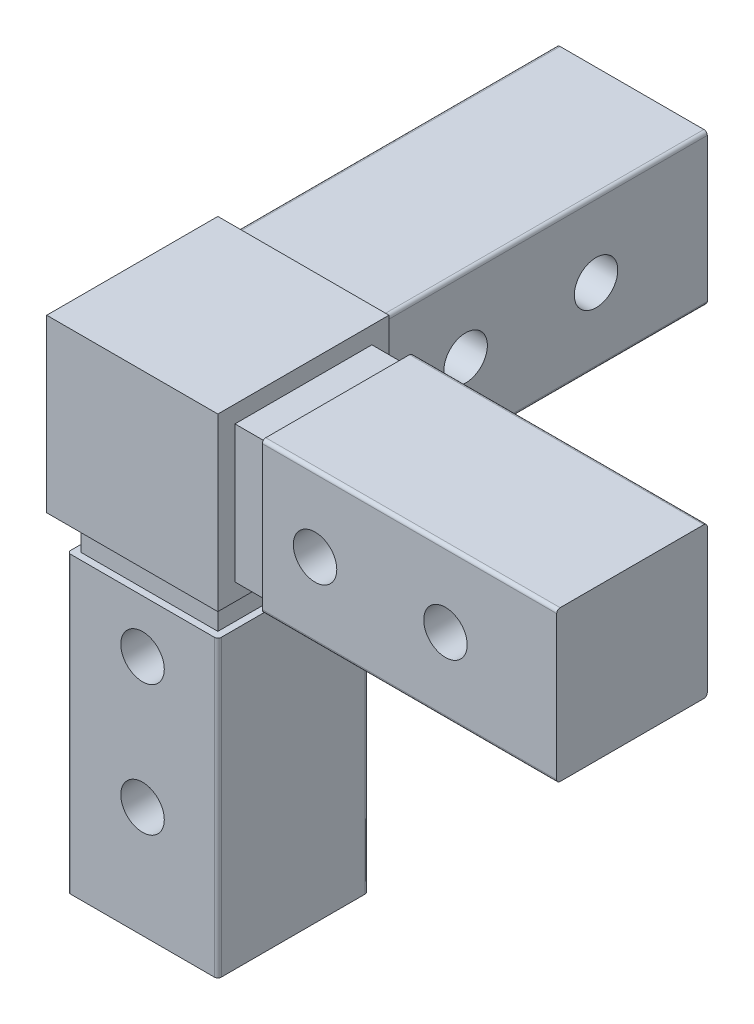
from build123d import *

# Parameters (mm, degrees)
SKETCH1_W            = 22.5
SKETCH1_H            = 22.5
BOSS_EXTRUDE1_DEPTH  = 20
SKETCH2_W            = 20
SKETCH2_H            = 20
BOSS_EXTRUDE2_DEPTH  = 5
SKETCH3_W            = 20
SKETCH3_H            = 20
BOSS_EXTRUDE3_DEPTH  = 5
SKETCH4_W            = 21
SKETCH4_H            = 21
BOSS_EXTRUDE4_DEPTH  = 43
SKETCH5_W            = 22
SKETCH5_H            = 22
BOSS_EXTRUDE5_DEPTH  = 43
SKETCH6_W            = 22.5
SKETCH6_H            = 20
BOSS_EXTRUDE6_DEPTH  = 2.5
SKETCH7_W            = 22.5
SKETCH7_H            = 25
BOSS_EXTRUDE7_DEPTH  = 2.5
SKETCH8_W            = 22.5
SKETCH8_H            = 25
BOSS_EXTRUDE8_DEPTH  = 2.5
SKETCH9_W            = 25
SKETCH9_H            = 25
BOSS_EXTRUDE9_DEPTH  = 2.5
SKETCH10_W           = 43
SKETCH10_H           = 21
BOSS_EXTRUDE10_DEPTH = 1
SKETCH11_W           = 43
SKETCH11_H           = 22
BOSS_EXTRUDE11_DEPTH = 1
SKETCH12_W           = 22
SKETCH12_H           = 22
BOSS_EXTRUDE12_DEPTH = 48
FILLET1_R            = 0.5
SKETCH13_R           = 3.175
CUT_EXTRUDE1_DEPTH   = 22
SKETCH15_R           = 3.175
CUT_EXTRUDE2_DEPTH   = 22
SKETCH16_R           = 3.175
CUT_EXTRUDE3_DEPTH   = 22


with BuildPart() as part:
    # Sketch1 → Boss-Extrude1 (new body)
    with BuildSketch(Plane.XY.offset(10)):
        with Locations((1.25, -1.25)):
            Rectangle(SKETCH1_W, SKETCH1_H)
    extrude(amount=-BOSS_EXTRUDE1_DEPTH)

    # Sketch2 → Boss-Extrude2 (add)
    with BuildSketch(Plane.XZ.offset(12.5)):
        Rectangle(SKETCH2_W, SKETCH2_H)
    extrude(amount=BOSS_EXTRUDE2_DEPTH)

    # Sketch3 → Boss-Extrude3 (add)
    with BuildSketch(Plane(origin=(12.5, 0, 0), x_dir=(0, 0, -1), z_dir=(1, 0, 0))):
        Rectangle(SKETCH3_W, SKETCH3_H)
    extrude(amount=BOSS_EXTRUDE3_DEPTH)

    # Sketch4 → Boss-Extrude4 (add)
    with BuildSketch(Plane(origin=(17.5, 0, 0), x_dir=(0, 0, -1), z_dir=(1, 0, 0))):
        with Locations((0.5, 0.5)):
            Rectangle(SKETCH4_W, SKETCH4_H)
    extrude(amount=BOSS_EXTRUDE4_DEPTH)

    # Sketch5 → Boss-Extrude5 (add)
    with BuildSketch(Plane(origin=(0, -17.5, 0), x_dir=(1, 0, 0), z_dir=(0, 1, 0))):
        Rectangle(SKETCH5_W, SKETCH5_H)
    extrude(amount=-BOSS_EXTRUDE5_DEPTH)

    # Sketch6 → Boss-Extrude6 (add)
    with BuildSketch(Plane(origin=(0, 10, 0), x_dir=(-1, 0, 0), z_dir=(0, 1, 0))):
        with Locations((-1.25, 0)):
            Rectangle(SKETCH6_W, SKETCH6_H)
    extrude(amount=BOSS_EXTRUDE6_DEPTH)

    # Sketch7 → Boss-Extrude7 (add)
    with BuildSketch(Plane.XY.offset(10)):
        with Locations((1.25, 0)):
            Rectangle(SKETCH7_W, SKETCH7_H)
    extrude(amount=BOSS_EXTRUDE7_DEPTH)

    # Sketch8 → Boss-Extrude8 (add)
    with BuildSketch(Plane.ZY.offset(10)):
        with Locations((1.25, 0)):
            Rectangle(SKETCH8_W, SKETCH8_H)
    extrude(amount=BOSS_EXTRUDE8_DEPTH)

    # Sketch9 → Boss-Extrude9 (add)
    with BuildSketch(Plane(origin=(0, 0, -10), x_dir=(-1, 0, 0), z_dir=(0, 0, -1))):
        Rectangle(SKETCH9_W, SKETCH9_H)
    extrude(amount=BOSS_EXTRUDE9_DEPTH)

    # Sketch10 → Boss-Extrude10 (add)
    with BuildSketch(Plane.XZ.offset(10)):
        with Locations((39, -0.5)):
            Rectangle(SKETCH10_W, SKETCH10_H)
    extrude(amount=BOSS_EXTRUDE10_DEPTH)

    # Sketch11 → Boss-Extrude11 (add)
    with BuildSketch(Plane.XY.offset(10)):
        with Locations((39, 0)):
            Rectangle(SKETCH11_W, SKETCH11_H)
    extrude(amount=BOSS_EXTRUDE11_DEPTH)

    # Sketch12 → Boss-Extrude12 (add)
    with BuildSketch(Plane(origin=(0, 0, -12.5), x_dir=(-1, 0, 0), z_dir=(0, 0, -1))):
        Rectangle(SKETCH12_W, SKETCH12_H)
    extrude(amount=BOSS_EXTRUDE12_DEPTH)

    # Fillet1
    fillet1_edges = [part.edges().sort_by_distance(p)[0] for p in [
        (39, -11, -11),
        (39, 11, 11),
        (39, -11, 11),
        (-11, -11, -36.5),
        (-11, 11, -36.5),
        (11, 11, -36.5),
        (11, -11, -36.5),
        (39, 11, -11),
        (-11, -39, -11),
        (11, -39, -11),
        (11, -39, 11),
        (-11, -39, 11),
    ]]
    fillet(fillet1_edges, radius=FILLET1_R)

    # Sketch13 → Cut-Extrude1 (cut)
    with BuildSketch(Plane.XY.offset(11)):
        with Locations((44.25, 0)):
            Circle(SKETCH13_R)
        with Locations((25.2, 0)):
            Circle(SKETCH13_R)
    extrude(amount=-CUT_EXTRUDE1_DEPTH, mode=Mode.SUBTRACT)

    # Sketch15 → Cut-Extrude2 (cut)
    with BuildSketch(Plane.XY.offset(11)):
        with Locations((0, -44.25)):
            Circle(SKETCH15_R)
        with Locations((0, -25.2)):
            Circle(SKETCH15_R)
    extrude(amount=-CUT_EXTRUDE2_DEPTH, mode=Mode.SUBTRACT)

    # Sketch16 → Cut-Extrude3 (cut)
    with BuildSketch(Plane.ZY.offset(11)):
        with Locations((-25.2, 0)):
            Circle(SKETCH16_R)
        with Locations((-44.25, 0)):
            Circle(SKETCH16_R)
    extrude(amount=-CUT_EXTRUDE3_DEPTH, mode=Mode.SUBTRACT)


solid = part.part
